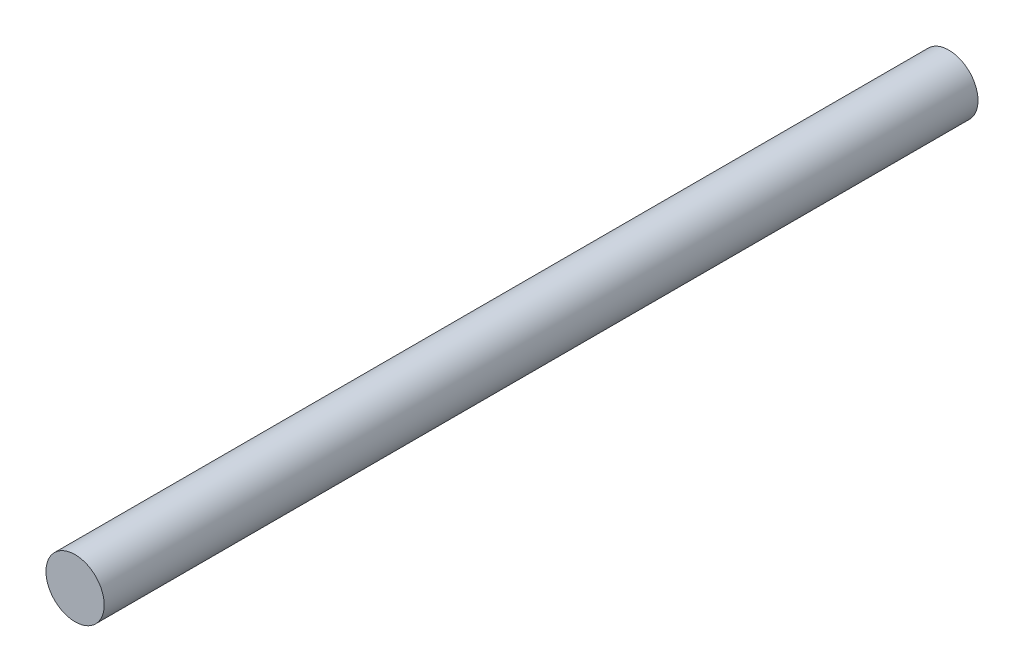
ISO-10303-21;
HEADER;
FILE_DESCRIPTION(('STEP AP214'),'2;1');
FILE_NAME('part.step','',(''),(''),'','','');
FILE_SCHEMA(('AUTOMOTIVE_DESIGN { 1 0 10303 214 1 1 1 1 }'));
ENDSEC;
DATA;
#1=APPLICATION_CONTEXT('core data for automotive mechanical design processes');
#2=APPLICATION_PROTOCOL_DEFINITION('international standard','automotive_design',2000,#1);
#3=PRODUCT_CONTEXT('',#1,'mechanical');
#4=PRODUCT('Part','Part','',(#3));
#5=PRODUCT_RELATED_PRODUCT_CATEGORY('part','',(#4));
#6=PRODUCT_DEFINITION_FORMATION('','',#4);
#7=PRODUCT_DEFINITION_CONTEXT('part definition',#1,'design');
#8=PRODUCT_DEFINITION('design','',#6,#7);
#9=PRODUCT_DEFINITION_SHAPE('','',#8);
#10=(LENGTH_UNIT() NAMED_UNIT(*) SI_UNIT(.MILLI.,.METRE.));
#11=(NAMED_UNIT(*) PLANE_ANGLE_UNIT() SI_UNIT($,.RADIAN.));
#12=(NAMED_UNIT(*) SI_UNIT($,.STERADIAN.) SOLID_ANGLE_UNIT());
#13=UNCERTAINTY_MEASURE_WITH_UNIT(LENGTH_MEASURE(1.E-05),#10,'distance_accuracy_value','');
#14=(GEOMETRIC_REPRESENTATION_CONTEXT(3) GLOBAL_UNCERTAINTY_ASSIGNED_CONTEXT((#13)) GLOBAL_UNIT_ASSIGNED_CONTEXT((#10,
#11,#12)) REPRESENTATION_CONTEXT('',''));
#15=CARTESIAN_POINT('',(0.,0.,0.));
#16=DIRECTION('',(0.,0.,1.));
#17=DIRECTION('',(1.,0.,0.));
#18=AXIS2_PLACEMENT_3D('',#15,#16,#17);
#19=CARTESIAN_POINT('',(0.,0.,-900.));
#20=DIRECTION('',(0.,0.,1.));
#21=DIRECTION('',(1.,0.,0.));
#22=AXIS2_PLACEMENT_3D('',#19,#20,#21);
#23=CYLINDRICAL_SURFACE('',#22,30.);
#24=CARTESIAN_POINT('',(0.,0.,-900.));
#25=DIRECTION('',(0.,0.,1.));
#26=DIRECTION('',(1.,0.,0.));
#27=AXIS2_PLACEMENT_3D('',#24,#25,#26);
#28=CIRCLE('',#27,30.);
#29=CARTESIAN_POINT('',(30.,0.,-900.));
#30=VERTEX_POINT('',#29);
#31=EDGE_CURVE('E10',#30,#30,#28,.T.);
#32=ORIENTED_EDGE('',*,*,#31,.T.);
#33=EDGE_LOOP('',(#32));
#34=FACE_BOUND('',#33,.T.);
#35=CARTESIAN_POINT('',(0.,0.,0.));
#36=DIRECTION('',(0.,0.,1.));
#37=DIRECTION('',(1.,0.,0.));
#38=AXIS2_PLACEMENT_3D('',#35,#36,#37);
#39=CIRCLE('',#38,30.);
#40=CARTESIAN_POINT('',(30.,0.,0.));
#41=VERTEX_POINT('',#40);
#42=EDGE_CURVE('E40',#41,#41,#39,.T.);
#43=ORIENTED_EDGE('',*,*,#42,.F.);
#44=EDGE_LOOP('',(#43));
#45=FACE_BOUND('',#44,.T.);
#46=ADVANCED_FACE('F37',(#34,#45),#23,.T.);
#47=CARTESIAN_POINT('',(0.,0.,-900.));
#48=DIRECTION('',(0.,0.,1.));
#49=DIRECTION('',(1.,0.,0.));
#50=AXIS2_PLACEMENT_3D('',#47,#48,#49);
#51=PLANE('',#50);
#52=ORIENTED_EDGE('',*,*,#31,.F.);
#53=EDGE_LOOP('',(#52));
#54=FACE_BOUND('',#53,.T.);
#55=ADVANCED_FACE('F54',(#54),#51,.F.);
#56=CARTESIAN_POINT('',(0.,0.,0.));
#57=DIRECTION('',(0.,0.,1.));
#58=DIRECTION('',(1.,0.,0.));
#59=AXIS2_PLACEMENT_3D('',#56,#57,#58);
#60=PLANE('',#59);
#61=ORIENTED_EDGE('',*,*,#42,.T.);
#62=EDGE_LOOP('',(#61));
#63=FACE_BOUND('',#62,.T.);
#64=ADVANCED_FACE('F51',(#63),#60,.T.);
#65=CLOSED_SHELL('',(#46,#55,#64));
#66=MANIFOLD_SOLID_BREP('B2',#65);
#67=ADVANCED_BREP_SHAPE_REPRESENTATION('',(#18,#66),#14);
#68=SHAPE_DEFINITION_REPRESENTATION(#9,#67);
ENDSEC;
END-ISO-10303-21;
